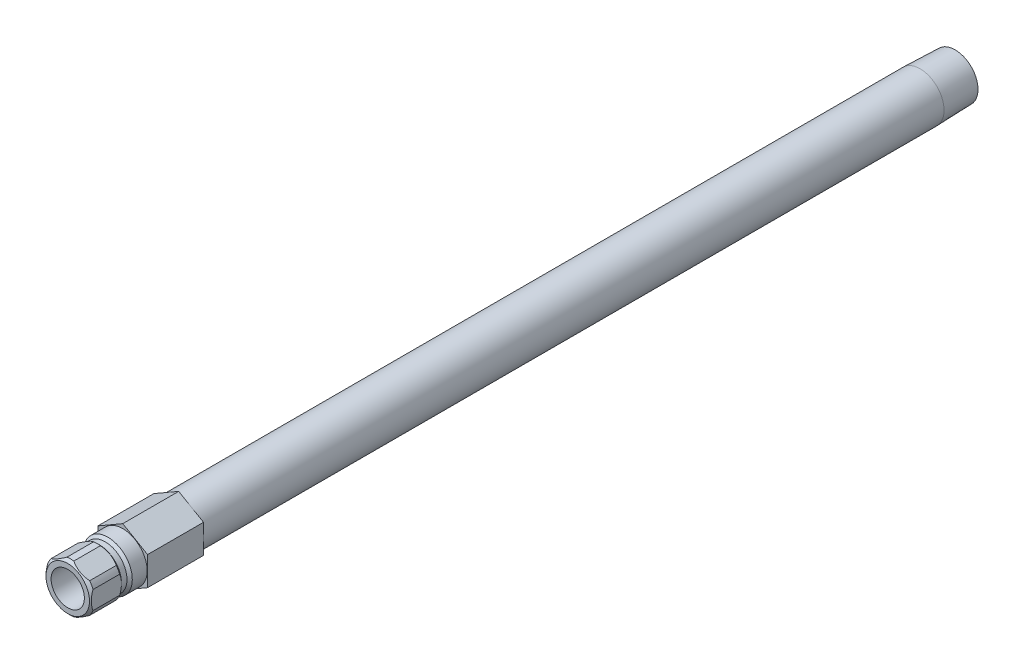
ISO-10303-21;
HEADER;
FILE_DESCRIPTION(('STEP AP214'),'2;1');
FILE_NAME('part.step','',(''),(''),'','','');
FILE_SCHEMA(('AUTOMOTIVE_DESIGN { 1 0 10303 214 1 1 1 1 }'));
ENDSEC;
DATA;
#1=APPLICATION_CONTEXT('core data for automotive mechanical design processes');
#2=APPLICATION_PROTOCOL_DEFINITION('international standard','automotive_design',2000,#1);
#3=PRODUCT_CONTEXT('',#1,'mechanical');
#4=PRODUCT('Part','Part','',(#3));
#5=PRODUCT_RELATED_PRODUCT_CATEGORY('part','',(#4));
#6=PRODUCT_DEFINITION_FORMATION('','',#4);
#7=PRODUCT_DEFINITION_CONTEXT('part definition',#1,'design');
#8=PRODUCT_DEFINITION('design','',#6,#7);
#9=PRODUCT_DEFINITION_SHAPE('','',#8);
#10=(LENGTH_UNIT() NAMED_UNIT(*) SI_UNIT(.MILLI.,.METRE.));
#11=(NAMED_UNIT(*) PLANE_ANGLE_UNIT() SI_UNIT($,.RADIAN.));
#12=(NAMED_UNIT(*) SI_UNIT($,.STERADIAN.) SOLID_ANGLE_UNIT());
#13=UNCERTAINTY_MEASURE_WITH_UNIT(LENGTH_MEASURE(1.E-05),#10,'distance_accuracy_value','');
#14=(GEOMETRIC_REPRESENTATION_CONTEXT(3) GLOBAL_UNCERTAINTY_ASSIGNED_CONTEXT((#13)) GLOBAL_UNIT_ASSIGNED_CONTEXT((#10,
#11,#12)) REPRESENTATION_CONTEXT('',''));
#15=CARTESIAN_POINT('',(0.,0.,0.));
#16=DIRECTION('',(0.,0.,1.));
#17=DIRECTION('',(1.,0.,0.));
#18=AXIS2_PLACEMENT_3D('',#15,#16,#17);
#19=CARTESIAN_POINT('',(0.,0.,12.8748331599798));
#20=DIRECTION('',(0.,0.,-1.));
#21=DIRECTION('',(0.,1.,0.));
#22=AXIS2_PLACEMENT_3D('',#19,#20,#21);
#23=CYLINDRICAL_SURFACE('',#22,6.985);
#24=DIRECTION('',(0.,0.,-1.));
#25=VECTOR('',#24,1.);
#26=CARTESIAN_POINT('',(5.50323442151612,-4.30170151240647,12.8748331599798));
#27=LINE('',#26,#25);
#28=CARTESIAN_POINT('',(5.50323442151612,-4.30170151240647,7.366));
#29=VERTEX_POINT('',#28);
#30=CARTESIAN_POINT('',(5.50323442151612,-4.30170151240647,14.986));
#31=VERTEX_POINT('',#30);
#32=EDGE_CURVE('E452',#29,#31,#27,.F.);
#33=ORIENTED_EDGE('',*,*,#32,.F.);
#34=CARTESIAN_POINT('',(0.,0.,7.366));
#35=DIRECTION('',(0.,0.,-1.));
#36=DIRECTION('',(0.,1.,0.));
#37=AXIS2_PLACEMENT_3D('',#34,#35,#36);
#38=CIRCLE('',#37,6.985);
#39=CARTESIAN_POINT('',(6.477,-2.6150900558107,7.366));
#40=VERTEX_POINT('',#39);
#41=EDGE_CURVE('E190',#40,#29,#38,.T.);
#42=ORIENTED_EDGE('',*,*,#41,.F.);
#43=DIRECTION('',(0.,0.,-1.));
#44=VECTOR('',#43,1.);
#45=CARTESIAN_POINT('',(6.477,-2.6150900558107,12.8748331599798));
#46=LINE('',#45,#44);
#47=CARTESIAN_POINT('',(6.477,-2.6150900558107,14.986));
#48=VERTEX_POINT('',#47);
#49=EDGE_CURVE('E367',#48,#40,#46,.T.);
#50=ORIENTED_EDGE('',*,*,#49,.F.);
#51=CARTESIAN_POINT('',(0.,0.,14.986));
#52=DIRECTION('',(0.,0.,-1.));
#53=DIRECTION('',(0.,1.,0.));
#54=AXIS2_PLACEMENT_3D('',#51,#52,#53);
#55=CIRCLE('',#54,6.985);
#56=EDGE_CURVE('E355',#48,#31,#55,.T.);
#57=ORIENTED_EDGE('',*,*,#56,.T.);
#58=EDGE_LOOP('',(#33,#42,#50,#57));
#59=FACE_BOUND('',#58,.T.);
#60=ADVANCED_FACE('F34',(#59),#23,.T.);
#61=DIRECTION('',(0.,0.,-1.));
#62=VECTOR('',#61,1.);
#63=CARTESIAN_POINT('',(6.477,2.6150900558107,12.8748331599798));
#64=LINE('',#63,#62);
#65=CARTESIAN_POINT('',(6.477,2.6150900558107,7.366));
#66=VERTEX_POINT('',#65);
#67=CARTESIAN_POINT('',(6.477,2.6150900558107,14.986));
#68=VERTEX_POINT('',#67);
#69=EDGE_CURVE('E279',#66,#68,#64,.F.);
#70=ORIENTED_EDGE('',*,*,#69,.F.);
#71=CARTESIAN_POINT('',(5.50323442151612,4.30170151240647,7.366));
#72=VERTEX_POINT('',#71);
#73=EDGE_CURVE('E193',#72,#66,#38,.T.);
#74=ORIENTED_EDGE('',*,*,#73,.F.);
#75=DIRECTION('',(0.,0.,-1.));
#76=VECTOR('',#75,1.);
#77=CARTESIAN_POINT('',(5.50323442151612,4.30170151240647,12.8748331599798));
#78=LINE('',#77,#76);
#79=CARTESIAN_POINT('',(5.50323442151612,4.30170151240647,14.986));
#80=VERTEX_POINT('',#79);
#81=EDGE_CURVE('E351',#80,#72,#78,.T.);
#82=ORIENTED_EDGE('',*,*,#81,.F.);
#83=EDGE_CURVE('E205',#80,#68,#55,.T.);
#84=ORIENTED_EDGE('',*,*,#83,.T.);
#85=EDGE_LOOP('',(#70,#74,#82,#84));
#86=FACE_BOUND('',#85,.T.);
#87=ADVANCED_FACE('F313',(#86),#23,.T.);
#88=DIRECTION('',(0.,0.,-1.));
#89=VECTOR('',#88,1.);
#90=CARTESIAN_POINT('',(0.973765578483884,6.91679156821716,12.8748331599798));
#91=LINE('',#90,#89);
#92=CARTESIAN_POINT('',(0.973765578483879,6.91679156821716,7.366));
#93=VERTEX_POINT('',#92);
#94=CARTESIAN_POINT('',(0.973765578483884,6.91679156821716,14.986));
#95=VERTEX_POINT('',#94);
#96=EDGE_CURVE('E370',#93,#95,#91,.F.);
#97=ORIENTED_EDGE('',*,*,#96,.F.);
#98=CARTESIAN_POINT('',(-0.97376557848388,6.91679156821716,7.366));
#99=VERTEX_POINT('',#98);
#100=EDGE_CURVE('E195',#99,#93,#38,.T.);
#101=ORIENTED_EDGE('',*,*,#100,.F.);
#102=DIRECTION('',(0.,0.,-1.));
#103=VECTOR('',#102,1.);
#104=CARTESIAN_POINT('',(-0.973765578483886,6.91679156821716,12.8748331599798));
#105=LINE('',#104,#103);
#106=CARTESIAN_POINT('',(-0.973765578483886,6.91679156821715,14.986));
#107=VERTEX_POINT('',#106);
#108=EDGE_CURVE('E54',#107,#99,#105,.T.);
#109=ORIENTED_EDGE('',*,*,#108,.F.);
#110=EDGE_CURVE('E201',#107,#95,#55,.T.);
#111=ORIENTED_EDGE('',*,*,#110,.T.);
#112=EDGE_LOOP('',(#97,#101,#109,#111));
#113=FACE_BOUND('',#112,.T.);
#114=ADVANCED_FACE('F318',(#113),#23,.T.);
#115=DIRECTION('',(0.,0.,-1.));
#116=VECTOR('',#115,1.);
#117=CARTESIAN_POINT('',(-5.50323442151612,4.30170151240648,12.8748331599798));
#118=LINE('',#117,#116);
#119=CARTESIAN_POINT('',(-5.50323442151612,4.30170151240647,7.366));
#120=VERTEX_POINT('',#119);
#121=CARTESIAN_POINT('',(-5.50323442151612,4.30170151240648,14.986));
#122=VERTEX_POINT('',#121);
#123=EDGE_CURVE('E349',#120,#122,#118,.F.);
#124=ORIENTED_EDGE('',*,*,#123,.F.);
#125=CARTESIAN_POINT('',(-6.477,2.61509005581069,7.366));
#126=VERTEX_POINT('',#125);
#127=EDGE_CURVE('E194',#126,#120,#38,.T.);
#128=ORIENTED_EDGE('',*,*,#127,.F.);
#129=DIRECTION('',(0.,0.,-1.));
#130=VECTOR('',#129,1.);
#131=CARTESIAN_POINT('',(-6.477,2.61509005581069,12.8748331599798));
#132=LINE('',#131,#130);
#133=CARTESIAN_POINT('',(-6.477,2.61509005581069,14.986));
#134=VERTEX_POINT('',#133);
#135=EDGE_CURVE('E62',#134,#126,#132,.T.);
#136=ORIENTED_EDGE('',*,*,#135,.F.);
#137=EDGE_CURVE('E204',#134,#122,#55,.T.);
#138=ORIENTED_EDGE('',*,*,#137,.T.);
#139=EDGE_LOOP('',(#124,#128,#136,#138));
#140=FACE_BOUND('',#139,.T.);
#141=ADVANCED_FACE('F329',(#140),#23,.T.);
#142=DIRECTION('',(0.,0.,-1.));
#143=VECTOR('',#142,1.);
#144=CARTESIAN_POINT('',(-6.477,-2.61509005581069,12.8748331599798));
#145=LINE('',#144,#143);
#146=CARTESIAN_POINT('',(-6.477,-2.61509005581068,7.366));
#147=VERTEX_POINT('',#146);
#148=CARTESIAN_POINT('',(-6.477,-2.61509005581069,14.986));
#149=VERTEX_POINT('',#148);
#150=EDGE_CURVE('E340',#147,#149,#145,.F.);
#151=ORIENTED_EDGE('',*,*,#150,.F.);
#152=CARTESIAN_POINT('',(-5.50323442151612,-4.30170151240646,7.366));
#153=VERTEX_POINT('',#152);
#154=EDGE_CURVE('E191',#153,#147,#38,.T.);
#155=ORIENTED_EDGE('',*,*,#154,.F.);
#156=DIRECTION('',(0.,0.,-1.));
#157=VECTOR('',#156,1.);
#158=CARTESIAN_POINT('',(-5.50323442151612,-4.30170151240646,12.8748331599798));
#159=LINE('',#158,#157);
#160=CARTESIAN_POINT('',(-5.50323442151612,-4.30170151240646,14.986));
#161=VERTEX_POINT('',#160);
#162=EDGE_CURVE('E168',#161,#153,#159,.T.);
#163=ORIENTED_EDGE('',*,*,#162,.F.);
#164=EDGE_CURVE('E342',#161,#149,#55,.T.);
#165=ORIENTED_EDGE('',*,*,#164,.T.);
#166=EDGE_LOOP('',(#151,#155,#163,#165));
#167=FACE_BOUND('',#166,.T.);
#168=ADVANCED_FACE('F322',(#167),#23,.T.);
#169=CARTESIAN_POINT('',(0.,0.,12.8748331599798));
#170=DIRECTION('',(0.,0.,-1.));
#171=DIRECTION('',(0.,1.,0.));
#172=AXIS2_PLACEMENT_3D('',#169,#170,#171);
#173=CYLINDRICAL_SURFACE('',#172,6.85799999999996);
#174=CARTESIAN_POINT('',(0.,0.,-228.219));
#175=DIRECTION('',(0.,0.,-1.));
#176=DIRECTION('',(0.,1.,0.));
#177=AXIS2_PLACEMENT_3D('',#174,#175,#176);
#178=CIRCLE('',#177,6.85799999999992);
#179=CARTESIAN_POINT('',(0.,6.858,-228.219));
#180=VERTEX_POINT('',#179);
#181=EDGE_CURVE('E520',#180,#180,#178,.T.);
#182=ORIENTED_EDGE('',*,*,#181,.F.);
#183=EDGE_LOOP('',(#182));
#184=FACE_BOUND('',#183,.T.);
#185=CARTESIAN_POINT('',(0.,0.,-16.002));
#186=DIRECTION('',(0.,0.,1.));
#187=DIRECTION('',(1.,0.,0.));
#188=AXIS2_PLACEMENT_3D('',#185,#186,#187);
#189=CIRCLE('',#188,6.85799999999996);
#190=CARTESIAN_POINT('',(6.85799999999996,0.,-16.002));
#191=VERTEX_POINT('',#190);
#192=EDGE_CURVE('E496',#191,#191,#189,.F.);
#193=ORIENTED_EDGE('',*,*,#192,.T.);
#194=EDGE_LOOP('',(#193));
#195=FACE_BOUND('',#194,.T.);
#196=ADVANCED_FACE('F328',(#184,#195),#173,.T.);
#197=CARTESIAN_POINT('',(0.,0.,12.8748331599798));
#198=DIRECTION('',(0.,0.,-1.));
#199=DIRECTION('',(0.,1.,0.));
#200=AXIS2_PLACEMENT_3D('',#197,#198,#199);
#201=CYLINDRICAL_SURFACE('',#200,4.7625);
#202=CARTESIAN_POINT('',(0.,0.,3.556));
#203=DIRECTION('',(0.,0.,-1.));
#204=DIRECTION('',(0.,1.,0.));
#205=AXIS2_PLACEMENT_3D('',#202,#203,#204);
#206=CIRCLE('',#205,4.76249999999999);
#207=CARTESIAN_POINT('',(0.,4.7625,3.556));
#208=VERTEX_POINT('',#207);
#209=EDGE_CURVE('E508',#208,#208,#206,.T.);
#210=ORIENTED_EDGE('',*,*,#209,.T.);
#211=EDGE_LOOP('',(#210));
#212=FACE_BOUND('',#211,.T.);
#213=CARTESIAN_POINT('',(0.,0.,15.748));
#214=DIRECTION('',(0.,0.,-1.));
#215=DIRECTION('',(0.,1.,0.));
#216=AXIS2_PLACEMENT_3D('',#213,#214,#215);
#217=CIRCLE('',#216,4.7625);
#218=CARTESIAN_POINT('',(0.,4.7625,15.748));
#219=VERTEX_POINT('',#218);
#220=EDGE_CURVE('E174',#219,#219,#217,.T.);
#221=ORIENTED_EDGE('',*,*,#220,.F.);
#222=EDGE_LOOP('',(#221));
#223=FACE_BOUND('',#222,.T.);
#224=ADVANCED_FACE('F36',(#212,#223),#201,.F.);
#225=CARTESIAN_POINT('',(0.,4.7625,15.748));
#226=DIRECTION('',(0.,0.,1.));
#227=DIRECTION('',(0.,-1.,0.));
#228=AXIS2_PLACEMENT_3D('',#225,#226,#227);
#229=PLANE('',#228);
#230=ORIENTED_EDGE('',*,*,#220,.T.);
#231=EDGE_LOOP('',(#230));
#232=FACE_BOUND('',#231,.T.);
#233=CARTESIAN_POINT('',(0.,0.,15.748));
#234=DIRECTION('',(0.,0.,-1.));
#235=DIRECTION('',(0.,1.,0.));
#236=AXIS2_PLACEMENT_3D('',#233,#234,#235);
#237=CIRCLE('',#236,6.223);
#238=CARTESIAN_POINT('',(0.,6.223,15.748));
#239=VERTEX_POINT('',#238);
#240=EDGE_CURVE('E206',#239,#239,#237,.T.);
#241=ORIENTED_EDGE('',*,*,#240,.F.);
#242=EDGE_LOOP('',(#241));
#243=FACE_BOUND('',#242,.T.);
#244=ADVANCED_FACE('F241',(#232,#243),#229,.T.);
#245=CARTESIAN_POINT('',(0.,0.,14.986));
#246=DIRECTION('',(0.,0.,-1.));
#247=DIRECTION('',(0.,1.,0.));
#248=AXIS2_PLACEMENT_3D('',#245,#246,#247);
#249=CONICAL_SURFACE('',#248,6.985,0.785398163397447);
#250=CARTESIAN_POINT('',(5.50369701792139,-4.30143443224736,14.9858));
#251=CARTESIAN_POINT('',(5.32269478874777,-4.40593611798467,15.0641166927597));
#252=CARTESIAN_POINT('',(5.13917907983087,-4.51188896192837,15.1353544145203));
#253=CARTESIAN_POINT('',(4.76736839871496,-4.72655395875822,15.2608524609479));
#254=CARTESIAN_POINT('',(4.57906245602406,-4.83527244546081,15.3150691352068));
#255=CARTESIAN_POINT('',(4.20553846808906,-5.05092662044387,15.401724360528));
#256=CARTESIAN_POINT('',(4.02044501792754,-5.15779037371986,15.4348622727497));
#257=CARTESIAN_POINT('',(3.64855359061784,-5.37250198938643,15.4802195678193));
#258=CARTESIAN_POINT('',(3.46175806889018,-5.48034843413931,15.4924653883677));
#259=CARTESIAN_POINT('',(3.08219421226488,-5.69948972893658,15.4953056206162));
#260=CARTESIAN_POINT('',(2.88942157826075,-5.81078706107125,15.4852117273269));
#261=CARTESIAN_POINT('',(2.50551871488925,-6.03243348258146,15.4426708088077));
#262=CARTESIAN_POINT('',(2.31439108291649,-6.14278107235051,15.4101933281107));
#263=CARTESIAN_POINT('',(1.92845877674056,-6.36559919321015,15.3234273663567));
#264=CARTESIAN_POINT('',(1.73378601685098,-6.47799356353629,15.268364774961));
#265=CARTESIAN_POINT('',(1.44558978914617,-6.6443837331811,15.1720079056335));
#266=CARTESIAN_POINT('',(1.35026676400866,-6.69941850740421,15.1376422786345));
#267=CARTESIAN_POINT('',(1.16086120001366,-6.80877186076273,15.0647445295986));
#268=CARTESIAN_POINT('',(1.06677820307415,-6.86309070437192,15.0262139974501));
#269=CARTESIAN_POINT('',(0.973302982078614,-6.91705864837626,14.9858));
#270=B_SPLINE_CURVE_WITH_KNOTS('',3,(#250,#251,#252,#253,#254,#255,#256,#257,#258,#259,#260,
#261,#262,#263,#264,#265,#266,#267,#268,#269),.UNSPECIFIED.,.F.,.F.,(4,2,2,2,2,2,2,2,2,4),(0.,
0.669810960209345,1.34132587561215,1.9892054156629,2.63626449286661,3.30353665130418,
3.97171850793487,4.66502165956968,5.01088265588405,5.35661208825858),.UNSPECIFIED.);
#271=CARTESIAN_POINT('',(0.973765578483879,-6.91679156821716,14.986));
#272=VERTEX_POINT('',#271);
#273=EDGE_CURVE('E451',#31,#272,#270,.T.);
#274=ORIENTED_EDGE('',*,*,#273,.F.);
#275=ORIENTED_EDGE('',*,*,#56,.F.);
#276=CARTESIAN_POINT('',(6.477,-7.50531717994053,12.0573066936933));
#277=CARTESIAN_POINT('',(6.477,-7.32278230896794,12.1954662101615));
#278=CARTESIAN_POINT('',(6.477,-7.13923073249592,12.3323042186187));
#279=CARTESIAN_POINT('',(6.477,-6.76969107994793,12.6027438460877));
#280=CARTESIAN_POINT('',(6.477,-6.58370240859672,12.7363446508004));
#281=CARTESIAN_POINT('',(6.477,-6.20752484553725,13.0006667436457));
#282=CARTESIAN_POINT('',(6.477,-6.01731457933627,13.1313577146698));
#283=CARTESIAN_POINT('',(6.477,-5.63367369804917,13.3879087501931));
#284=CARTESIAN_POINT('',(6.477,-5.44024331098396,13.5137691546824));
#285=CARTESIAN_POINT('',(6.477,-5.03831720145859,13.7667102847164));
#286=CARTESIAN_POINT('',(6.477,-4.8295984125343,13.893438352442));
#287=CARTESIAN_POINT('',(6.477,-4.4072839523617,14.1386241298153));
#288=CARTESIAN_POINT('',(6.477,-4.19368750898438,14.2570805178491));
#289=CARTESIAN_POINT('',(6.477,-3.7616267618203,14.4831715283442));
#290=CARTESIAN_POINT('',(6.477,-3.54317924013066,14.5908379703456));
#291=CARTESIAN_POINT('',(6.477,-3.100295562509,14.7929384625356));
#292=CARTESIAN_POINT('',(6.477,-2.87586219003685,14.8873785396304));
#293=CARTESIAN_POINT('',(6.477,-2.43955826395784,15.0524966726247));
#294=CARTESIAN_POINT('',(6.477,-2.22819339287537,15.1244971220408));
#295=CARTESIAN_POINT('',(6.477,-1.80033354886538,15.2515475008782));
#296=CARTESIAN_POINT('',(6.477,-1.58383822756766,15.3065962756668));
#297=CARTESIAN_POINT('',(6.477,-1.15063390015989,15.3959385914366));
#298=CARTESIAN_POINT('',(6.477,-0.934000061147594,15.4305906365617));
#299=CARTESIAN_POINT('',(6.477,-0.498364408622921,15.4784594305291));
#300=CARTESIAN_POINT('',(6.477,-0.279363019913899,15.4916799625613));
#301=CARTESIAN_POINT('',(6.477,0.150697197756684,15.4956835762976));
#302=CARTESIAN_POINT('',(6.477,0.361748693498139,15.4872823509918));
#303=CARTESIAN_POINT('',(6.477,0.782066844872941,15.4503172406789));
#304=CARTESIAN_POINT('',(6.477,0.991333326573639,15.421751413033));
#305=CARTESIAN_POINT('',(6.477,1.41010575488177,15.3455375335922));
#306=CARTESIAN_POINT('',(6.477,1.6195513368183,15.2975631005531));
#307=CARTESIAN_POINT('',(6.477,2.03387291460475,15.1851046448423));
#308=CARTESIAN_POINT('',(6.477,2.2387492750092,15.1206219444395));
#309=CARTESIAN_POINT('',(6.477,2.66141718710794,14.9715598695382));
#310=CARTESIAN_POINT('',(6.477,2.87875617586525,14.8857103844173));
#311=CARTESIAN_POINT('',(6.477,3.30779766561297,14.7008180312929));
#312=CARTESIAN_POINT('',(6.477,3.51949749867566,14.6017690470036));
#313=CARTESIAN_POINT('',(6.477,3.9382898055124,14.3928329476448));
#314=CARTESIAN_POINT('',(6.477,4.14536521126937,14.282911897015));
#315=CARTESIAN_POINT('',(6.477,4.55475391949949,14.0546596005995));
#316=CARTESIAN_POINT('',(6.477,4.75706796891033,13.93632968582));
#317=CARTESIAN_POINT('',(6.477,5.14761370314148,13.6989609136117));
#318=CARTESIAN_POINT('',(6.477,5.33604552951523,13.580249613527));
#319=CARTESIAN_POINT('',(6.477,5.70967381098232,13.3378251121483));
#320=CARTESIAN_POINT('',(6.477,5.89487001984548,13.2141115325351));
#321=CARTESIAN_POINT('',(6.477,6.26095063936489,12.9635958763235));
#322=CARTESIAN_POINT('',(6.477,6.44185783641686,12.8368269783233));
#323=CARTESIAN_POINT('',(6.477,6.80119835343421,12.5799293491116));
#324=CARTESIAN_POINT('',(6.477,6.97963234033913,12.4498015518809));
#325=CARTESIAN_POINT('',(6.477,7.15703038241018,12.3183002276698));
#326=B_SPLINE_CURVE_WITH_KNOTS('',3,(#276,#277,#278,#279,#280,#281,#282,#283,#284,#285,#286,
#287,#288,#289,#290,#291,#292,#293,#294,#295,#296,#297,#298,#299,#300,#301,#302,#303,#304,#305,
#306,#307,#308,#309,#310,#311,#312,#313,#314,#315,#316,#317,#318,#319,#320,#321,#322,#323,#324,
#325),.UNSPECIFIED.,.F.,.F.,(4,2,2,2,2,2,2,2,2,2,2,2,2,2,2,2,2,2,2,2,2,2,2,2,4),(0.,
0.686790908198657,1.37375281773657,2.06603541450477,2.75826919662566,3.49065471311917,
4.22315698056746,4.95343127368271,5.68337170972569,6.35265989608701,7.02199365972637,
7.67918147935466,8.33625327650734,8.96890298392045,9.6016136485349,10.2454384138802,
10.8892116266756,11.5897073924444,12.2905288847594,12.9936114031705,13.6965828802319,
14.3646145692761,15.0326968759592,15.6953618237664,16.3578444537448),.UNSPECIFIED.);
#327=EDGE_CURVE('E271',#68,#48,#326,.F.);
#328=ORIENTED_EDGE('',*,*,#327,.F.);
#329=ORIENTED_EDGE('',*,*,#83,.F.);
#330=CARTESIAN_POINT('',(0.973302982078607,6.91705864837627,14.9858));
#331=CARTESIAN_POINT('',(1.15430521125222,6.81255696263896,15.0641166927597));
#332=CARTESIAN_POINT('',(1.33782092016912,6.70660411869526,15.1353544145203));
#333=CARTESIAN_POINT('',(1.70963160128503,6.49193912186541,15.2608524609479));
#334=CARTESIAN_POINT('',(1.89793754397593,6.38322063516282,15.3150691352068));
#335=CARTESIAN_POINT('',(2.27146153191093,6.16756646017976,15.401724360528));
#336=CARTESIAN_POINT('',(2.45655498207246,6.06070270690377,15.4348622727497));
#337=CARTESIAN_POINT('',(2.82844640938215,5.8459910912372,15.4802195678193));
#338=CARTESIAN_POINT('',(3.01524193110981,5.73814464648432,15.4924653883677));
#339=CARTESIAN_POINT('',(3.39480578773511,5.51900335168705,15.4953056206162));
#340=CARTESIAN_POINT('',(3.58757842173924,5.40770601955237,15.4852117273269));
#341=CARTESIAN_POINT('',(3.97148128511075,5.18605959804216,15.4426708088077));
#342=CARTESIAN_POINT('',(4.16260891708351,5.07571200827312,15.4101933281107));
#343=CARTESIAN_POINT('',(4.54854122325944,4.85289388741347,15.3234273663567));
#344=CARTESIAN_POINT('',(4.74321398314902,4.74049951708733,15.268364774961));
#345=CARTESIAN_POINT('',(5.03141021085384,4.57410934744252,15.1720079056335));
#346=CARTESIAN_POINT('',(5.12673323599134,4.51907457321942,15.1376422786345));
#347=CARTESIAN_POINT('',(5.31613879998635,4.40972121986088,15.0647445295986));
#348=CARTESIAN_POINT('',(5.41022179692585,4.3554023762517,15.0262139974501));
#349=CARTESIAN_POINT('',(5.50369701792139,4.30143443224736,14.9858));
#350=B_SPLINE_CURVE_WITH_KNOTS('',3,(#330,#331,#332,#333,#334,#335,#336,#337,#338,#339,#340,
#341,#342,#343,#344,#345,#346,#347,#348,#349),.UNSPECIFIED.,.F.,.F.,(4,2,2,2,2,2,2,2,2,4),(0.,
0.669810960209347,1.34132587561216,1.9892054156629,2.63626449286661,3.30353665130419,
3.97171850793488,4.66502165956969,5.01088265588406,5.35661208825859),.UNSPECIFIED.);
#351=EDGE_CURVE('E263',#95,#80,#350,.T.);
#352=ORIENTED_EDGE('',*,*,#351,.F.);
#353=ORIENTED_EDGE('',*,*,#110,.F.);
#354=CARTESIAN_POINT('',(-5.50369701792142,4.30143443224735,14.9858));
#355=CARTESIAN_POINT('',(-5.3226947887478,4.40593611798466,15.0641166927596));
#356=CARTESIAN_POINT('',(-5.1391790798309,4.51188896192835,15.1353544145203));
#357=CARTESIAN_POINT('',(-4.76736839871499,4.72655395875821,15.2608524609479));
#358=CARTESIAN_POINT('',(-4.57906245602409,4.8352724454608,15.3150691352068));
#359=CARTESIAN_POINT('',(-4.20553846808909,5.05092662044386,15.401724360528));
#360=CARTESIAN_POINT('',(-4.02044501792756,5.15779037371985,15.4348622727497));
#361=CARTESIAN_POINT('',(-3.64855359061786,5.37250198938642,15.4802195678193));
#362=CARTESIAN_POINT('',(-3.4617580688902,5.4803484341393,15.4924653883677));
#363=CARTESIAN_POINT('',(-3.0821942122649,5.69948972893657,15.4953056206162));
#364=CARTESIAN_POINT('',(-2.88942157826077,5.81078706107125,15.4852117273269));
#365=CARTESIAN_POINT('',(-2.50551871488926,6.03243348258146,15.4426708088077));
#366=CARTESIAN_POINT('',(-2.3143910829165,6.14278107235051,15.4101933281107));
#367=CARTESIAN_POINT('',(-1.92845877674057,6.36559919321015,15.3234273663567));
#368=CARTESIAN_POINT('',(-1.73378601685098,6.47799356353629,15.268364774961));
#369=CARTESIAN_POINT('',(-1.44558978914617,6.6443837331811,15.1720079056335));
#370=CARTESIAN_POINT('',(-1.35026676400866,6.69941850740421,15.1376422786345));
#371=CARTESIAN_POINT('',(-1.16086120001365,6.80877186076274,15.0647445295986));
#372=CARTESIAN_POINT('',(-1.06677820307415,6.86309070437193,15.0262139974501));
#373=CARTESIAN_POINT('',(-0.97330298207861,6.91705864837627,14.9858));
#374=B_SPLINE_CURVE_WITH_KNOTS('',3,(#354,#355,#356,#357,#358,#359,#360,#361,#362,#363,#364,
#365,#366,#367,#368,#369,#370,#371,#372,#373),.UNSPECIFIED.,.F.,.F.,(4,2,2,2,2,2,2,2,2,4),(0.,
0.66981096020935,1.34132587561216,1.98920541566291,2.63626449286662,3.3035366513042,
3.9717185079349,4.66502165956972,5.01088265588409,5.35661208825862),.UNSPECIFIED.);
#375=EDGE_CURVE('E256',#122,#107,#374,.T.);
#376=ORIENTED_EDGE('',*,*,#375,.F.);
#377=ORIENTED_EDGE('',*,*,#137,.F.);
#378=CARTESIAN_POINT('',(-6.477,-7.50531717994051,12.0573066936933));
#379=CARTESIAN_POINT('',(-6.477,-7.32278230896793,12.1954662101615));
#380=CARTESIAN_POINT('',(-6.477,-7.13923073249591,12.3323042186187));
#381=CARTESIAN_POINT('',(-6.477,-6.76969107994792,12.6027438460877));
#382=CARTESIAN_POINT('',(-6.477,-6.58370240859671,12.7363446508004));
#383=CARTESIAN_POINT('',(-6.477,-6.20752484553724,13.0006667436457));
#384=CARTESIAN_POINT('',(-6.477,-6.01731457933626,13.1313577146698));
#385=CARTESIAN_POINT('',(-6.477,-5.63367369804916,13.3879087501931));
#386=CARTESIAN_POINT('',(-6.477,-5.44024331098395,13.5137691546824));
#387=CARTESIAN_POINT('',(-6.477,-5.03831720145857,13.7667102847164));
#388=CARTESIAN_POINT('',(-6.477,-4.82959841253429,13.8934383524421));
#389=CARTESIAN_POINT('',(-6.477,-4.40728395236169,14.1386241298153));
#390=CARTESIAN_POINT('',(-6.477,-4.19368750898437,14.2570805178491));
#391=CARTESIAN_POINT('',(-6.477,-3.76162676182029,14.4831715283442));
#392=CARTESIAN_POINT('',(-6.477,-3.54317924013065,14.5908379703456));
#393=CARTESIAN_POINT('',(-6.477,-3.10029556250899,14.7929384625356));
#394=CARTESIAN_POINT('',(-6.477,-2.87586219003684,14.8873785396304));
#395=CARTESIAN_POINT('',(-6.477,-2.43955826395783,15.0524966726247));
#396=CARTESIAN_POINT('',(-6.477,-2.22819339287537,15.1244971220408));
#397=CARTESIAN_POINT('',(-6.477,-1.80033354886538,15.2515475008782));
#398=CARTESIAN_POINT('',(-6.477,-1.58383822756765,15.3065962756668));
#399=CARTESIAN_POINT('',(-6.477,-1.15063390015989,15.3959385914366));
#400=CARTESIAN_POINT('',(-6.477,-0.934000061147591,15.4305906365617));
#401=CARTESIAN_POINT('',(-6.477,-0.49836440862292,15.4784594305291));
#402=CARTESIAN_POINT('',(-6.477,-0.279363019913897,15.4916799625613));
#403=CARTESIAN_POINT('',(-6.477,0.150697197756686,15.4956835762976));
#404=CARTESIAN_POINT('',(-6.477,0.361748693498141,15.4872823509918));
#405=CARTESIAN_POINT('',(-6.477,0.782066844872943,15.4503172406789));
#406=CARTESIAN_POINT('',(-6.477,0.991333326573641,15.421751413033));
#407=CARTESIAN_POINT('',(-6.477,1.41010575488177,15.3455375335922));
#408=CARTESIAN_POINT('',(-6.477,1.6195513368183,15.2975631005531));
#409=CARTESIAN_POINT('',(-6.477,2.03387291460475,15.1851046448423));
#410=CARTESIAN_POINT('',(-6.477,2.2387492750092,15.1206219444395));
#411=CARTESIAN_POINT('',(-6.477,2.66141718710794,14.9715598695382));
#412=CARTESIAN_POINT('',(-6.477,2.87875617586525,14.8857103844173));
#413=CARTESIAN_POINT('',(-6.477,3.30779766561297,14.7008180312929));
#414=CARTESIAN_POINT('',(-6.477,3.51949749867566,14.6017690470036));
#415=CARTESIAN_POINT('',(-6.477,3.93828980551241,14.3928329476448));
#416=CARTESIAN_POINT('',(-6.477,4.14536521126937,14.282911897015));
#417=CARTESIAN_POINT('',(-6.477,4.55475391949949,14.0546596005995));
#418=CARTESIAN_POINT('',(-6.477,4.75706796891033,13.93632968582));
#419=CARTESIAN_POINT('',(-6.477,5.14761370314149,13.6989609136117));
#420=CARTESIAN_POINT('',(-6.477,5.33604552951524,13.580249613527));
#421=CARTESIAN_POINT('',(-6.477,5.70967381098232,13.3378251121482));
#422=CARTESIAN_POINT('',(-6.477,5.89487001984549,13.2141115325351));
#423=CARTESIAN_POINT('',(-6.477,6.2609506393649,12.9635958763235));
#424=CARTESIAN_POINT('',(-6.477,6.44185783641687,12.8368269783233));
#425=CARTESIAN_POINT('',(-6.477,6.80119835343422,12.5799293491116));
#426=CARTESIAN_POINT('',(-6.477,6.97963234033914,12.4498015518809));
#427=CARTESIAN_POINT('',(-6.477,7.15703038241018,12.3183002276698));
#428=B_SPLINE_CURVE_WITH_KNOTS('',3,(#378,#379,#380,#381,#382,#383,#384,#385,#386,#387,#388,
#389,#390,#391,#392,#393,#394,#395,#396,#397,#398,#399,#400,#401,#402,#403,#404,#405,#406,#407,
#408,#409,#410,#411,#412,#413,#414,#415,#416,#417,#418,#419,#420,#421,#422,#423,#424,#425,#426,
#427),.UNSPECIFIED.,.F.,.F.,(4,2,2,2,2,2,2,2,2,2,2,2,2,2,2,2,2,2,2,2,2,2,2,2,4),(0.,
0.686790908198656,1.37375281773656,2.06603541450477,2.75826919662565,3.49065471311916,
4.22315698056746,4.9534312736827,5.68337170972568,6.352659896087,7.02199365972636,
7.67918147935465,8.33625327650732,8.96890298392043,9.60161364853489,10.2454384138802,
10.8892116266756,11.5897073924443,12.2905288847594,12.9936114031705,13.6965828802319,
14.3646145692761,15.0326968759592,15.6953618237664,16.3578444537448),.UNSPECIFIED.);
#429=EDGE_CURVE('E249',#149,#134,#428,.T.);
#430=ORIENTED_EDGE('',*,*,#429,.F.);
#431=ORIENTED_EDGE('',*,*,#164,.F.);
#432=CARTESIAN_POINT('',(-0.973302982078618,-6.91705864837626,14.9858));
#433=CARTESIAN_POINT('',(-1.15430521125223,-6.81255696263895,15.0641166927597));
#434=CARTESIAN_POINT('',(-1.33782092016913,-6.70660411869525,15.1353544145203));
#435=CARTESIAN_POINT('',(-1.70963160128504,-6.49193912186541,15.2608524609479));
#436=CARTESIAN_POINT('',(-1.89793754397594,-6.38322063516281,15.3150691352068));
#437=CARTESIAN_POINT('',(-2.27146153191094,-6.16756646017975,15.401724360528));
#438=CARTESIAN_POINT('',(-2.45655498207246,-6.06070270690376,15.4348622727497));
#439=CARTESIAN_POINT('',(-2.82844640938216,-5.84599109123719,15.4802195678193));
#440=CARTESIAN_POINT('',(-3.01524193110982,-5.73814464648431,15.4924653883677));
#441=CARTESIAN_POINT('',(-3.39480578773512,-5.51900335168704,15.4953056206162));
#442=CARTESIAN_POINT('',(-3.58757842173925,-5.40770601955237,15.4852117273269));
#443=CARTESIAN_POINT('',(-3.97148128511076,-5.18605959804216,15.4426708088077));
#444=CARTESIAN_POINT('',(-4.16260891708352,-5.07571200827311,15.4101933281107));
#445=CARTESIAN_POINT('',(-4.54854122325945,-4.85289388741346,15.3234273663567));
#446=CARTESIAN_POINT('',(-4.74321398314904,-4.74049951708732,15.268364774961));
#447=CARTESIAN_POINT('',(-5.03141021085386,-4.57410934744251,15.1720079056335));
#448=CARTESIAN_POINT('',(-5.12673323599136,-4.5190745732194,15.1376422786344));
#449=CARTESIAN_POINT('',(-5.31613879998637,-4.40972121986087,15.0647445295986));
#450=CARTESIAN_POINT('',(-5.41022179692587,-4.35540237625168,15.0262139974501));
#451=CARTESIAN_POINT('',(-5.50369701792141,-4.30143443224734,14.9858));
#452=B_SPLINE_CURVE_WITH_KNOTS('',3,(#432,#433,#434,#435,#436,#437,#438,#439,#440,#441,#442,
#443,#444,#445,#446,#447,#448,#449,#450,#451),.UNSPECIFIED.,.F.,.F.,(4,2,2,2,2,2,2,2,2,4),(0.,
0.669810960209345,1.34132587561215,1.9892054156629,2.6362644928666,3.30353665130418,
3.97171850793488,4.6650216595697,5.01088265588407,5.35661208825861),.UNSPECIFIED.);
#453=CARTESIAN_POINT('',(-0.973765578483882,-6.91679156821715,14.986));
#454=VERTEX_POINT('',#453);
#455=EDGE_CURVE('E184',#454,#161,#452,.T.);
#456=ORIENTED_EDGE('',*,*,#455,.F.);
#457=EDGE_CURVE('E183',#272,#454,#55,.T.);
#458=ORIENTED_EDGE('',*,*,#457,.F.);
#459=EDGE_LOOP('',(#274,#275,#328,#329,#352,#353,#376,#377,#430,#431,#456,#458));
#460=FACE_BOUND('',#459,.T.);
#461=ORIENTED_EDGE('',*,*,#240,.T.);
#462=EDGE_LOOP('',(#461));
#463=FACE_BOUND('',#462,.T.);
#464=ADVANCED_FACE('F238',(#460,#463),#249,.T.);
#465=DIRECTION('',(0.,0.,-1.));
#466=VECTOR('',#465,1.);
#467=CARTESIAN_POINT('',(0.973765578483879,-6.91679156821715,12.8748331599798));
#468=LINE('',#467,#466);
#469=CARTESIAN_POINT('',(0.973765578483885,-6.91679156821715,7.366));
#470=VERTEX_POINT('',#469);
#471=EDGE_CURVE('E278',#272,#470,#468,.T.);
#472=ORIENTED_EDGE('',*,*,#471,.F.);
#473=ORIENTED_EDGE('',*,*,#457,.T.);
#474=DIRECTION('',(0.,0.,-1.));
#475=VECTOR('',#474,1.);
#476=CARTESIAN_POINT('',(-0.973765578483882,-6.91679156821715,12.8748331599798));
#477=LINE('',#476,#475);
#478=CARTESIAN_POINT('',(-0.973765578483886,-6.91679156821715,7.366));
#479=VERTEX_POINT('',#478);
#480=EDGE_CURVE('E165',#479,#454,#477,.F.);
#481=ORIENTED_EDGE('',*,*,#480,.F.);
#482=EDGE_CURVE('E181',#470,#479,#38,.T.);
#483=ORIENTED_EDGE('',*,*,#482,.F.);
#484=EDGE_LOOP('',(#472,#473,#481,#483));
#485=FACE_BOUND('',#484,.T.);
#486=ADVANCED_FACE('F180',(#485),#23,.T.);
#487=CARTESIAN_POINT('',(0.,0.,6.604));
#488=DIRECTION('',(0.,0.,1.));
#489=DIRECTION('',(0.,-1.,0.));
#490=AXIS2_PLACEMENT_3D('',#487,#488,#489);
#491=CONICAL_SURFACE('',#490,6.223,0.785398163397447);
#492=CARTESIAN_POINT('',(0.973302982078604,-6.91705864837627,7.3662));
#493=CARTESIAN_POINT('',(1.15430521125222,-6.81255696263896,7.28788330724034));
#494=CARTESIAN_POINT('',(1.33782092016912,-6.70660411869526,7.21664558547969));
#495=CARTESIAN_POINT('',(1.70963160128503,-6.49193912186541,7.09114753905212));
#496=CARTESIAN_POINT('',(1.89793754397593,-6.38322063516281,7.03693086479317));
#497=CARTESIAN_POINT('',(2.27146153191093,-6.16756646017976,6.95027563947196));
#498=CARTESIAN_POINT('',(2.45655498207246,-6.06070270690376,6.91713772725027));
#499=CARTESIAN_POINT('',(2.82844640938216,-5.8459910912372,6.87178043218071));
#500=CARTESIAN_POINT('',(3.01524193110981,-5.73814464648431,6.85953461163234));
#501=CARTESIAN_POINT('',(3.39480578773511,-5.51900335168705,6.85669437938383));
#502=CARTESIAN_POINT('',(3.58757842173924,-5.40770601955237,6.86678827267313));
#503=CARTESIAN_POINT('',(3.97148128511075,-5.18605959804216,6.9093291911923));
#504=CARTESIAN_POINT('',(4.16260891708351,-5.07571200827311,6.9418066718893));
#505=CARTESIAN_POINT('',(4.54854122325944,-4.85289388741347,7.02857263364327));
#506=CARTESIAN_POINT('',(4.74321398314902,-4.74049951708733,7.08363522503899));
#507=CARTESIAN_POINT('',(5.03141021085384,-4.57410934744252,7.17999209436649));
#508=CARTESIAN_POINT('',(5.12673323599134,-4.51907457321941,7.21435772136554));
#509=CARTESIAN_POINT('',(5.31613879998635,-4.40972121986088,7.28725547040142));
#510=CARTESIAN_POINT('',(5.41022179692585,-4.35540237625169,7.32578600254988));
#511=CARTESIAN_POINT('',(5.50369701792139,-4.30143443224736,7.3662));
#512=B_SPLINE_CURVE_WITH_KNOTS('',3,(#492,#493,#494,#495,#496,#497,#498,#499,#500,#501,#502,
#503,#504,#505,#506,#507,#508,#509,#510,#511),.UNSPECIFIED.,.F.,.F.,(4,2,2,2,2,2,2,2,2,4),(0.,
0.669810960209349,1.34132587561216,1.9892054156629,2.63626449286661,3.30353665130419,
3.97171850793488,4.6650216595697,5.01088265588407,5.3566120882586),.UNSPECIFIED.);
#513=EDGE_CURVE('E12',#470,#29,#512,.T.);
#514=ORIENTED_EDGE('',*,*,#513,.F.);
#515=ORIENTED_EDGE('',*,*,#482,.T.);
#516=CARTESIAN_POINT('',(-5.50369701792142,-4.30143443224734,7.36620000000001));
#517=CARTESIAN_POINT('',(-5.32269478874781,-4.40593611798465,7.28788330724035));
#518=CARTESIAN_POINT('',(-5.13917907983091,-4.51188896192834,7.2166455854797));
#519=CARTESIAN_POINT('',(-4.767368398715,-4.7265539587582,7.09114753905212));
#520=CARTESIAN_POINT('',(-4.57906245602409,-4.83527244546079,7.03693086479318));
#521=CARTESIAN_POINT('',(-4.20553846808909,-5.05092662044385,6.95027563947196));
#522=CARTESIAN_POINT('',(-4.02044501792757,-5.15779037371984,6.91713772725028));
#523=CARTESIAN_POINT('',(-3.64855359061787,-5.37250198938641,6.87178043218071));
#524=CARTESIAN_POINT('',(-3.46175806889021,-5.48034843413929,6.85953461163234));
#525=CARTESIAN_POINT('',(-3.08219421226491,-5.69948972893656,6.85669437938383));
#526=CARTESIAN_POINT('',(-2.88942157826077,-5.81078706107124,6.86678827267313));
#527=CARTESIAN_POINT('',(-2.50551871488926,-6.03243348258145,6.9093291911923));
#528=CARTESIAN_POINT('',(-2.3143910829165,-6.1427810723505,6.9418066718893));
#529=CARTESIAN_POINT('',(-1.92845877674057,-6.36559919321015,7.02857263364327));
#530=CARTESIAN_POINT('',(-1.73378601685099,-6.47799356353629,7.08363522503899));
#531=CARTESIAN_POINT('',(-1.44558978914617,-6.6443837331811,7.17999209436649));
#532=CARTESIAN_POINT('',(-1.35026676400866,-6.69941850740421,7.21435772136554));
#533=CARTESIAN_POINT('',(-1.16086120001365,-6.80877186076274,7.28725547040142));
#534=CARTESIAN_POINT('',(-1.06677820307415,-6.86309070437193,7.32578600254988));
#535=CARTESIAN_POINT('',(-0.97330298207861,-6.91705864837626,7.3662));
#536=B_SPLINE_CURVE_WITH_KNOTS('',3,(#516,#517,#518,#519,#520,#521,#522,#523,#524,#525,#526,
#527,#528,#529,#530,#531,#532,#533,#534,#535),.UNSPECIFIED.,.F.,.F.,(4,2,2,2,2,2,2,2,2,4),(0.,
0.669810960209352,1.34132587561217,1.98920541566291,2.63626449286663,3.30353665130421,
3.9717185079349,4.66502165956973,5.0108826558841,5.35661208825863),.UNSPECIFIED.);
#537=EDGE_CURVE('E162',#153,#479,#536,.T.);
#538=ORIENTED_EDGE('',*,*,#537,.F.);
#539=ORIENTED_EDGE('',*,*,#154,.T.);
#540=CARTESIAN_POINT('',(-6.477,-7.50531717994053,10.2946933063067));
#541=CARTESIAN_POINT('',(-6.477,-7.32278230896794,10.1565337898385));
#542=CARTESIAN_POINT('',(-6.477,-7.13923073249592,10.0196957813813));
#543=CARTESIAN_POINT('',(-6.477,-6.76969107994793,9.74925615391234));
#544=CARTESIAN_POINT('',(-6.477,-6.58370240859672,9.61565534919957));
#545=CARTESIAN_POINT('',(-6.477,-6.20752484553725,9.35133325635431));
#546=CARTESIAN_POINT('',(-6.477,-6.01731457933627,9.22064228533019));
#547=CARTESIAN_POINT('',(-6.477,-5.63367369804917,8.96409124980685));
#548=CARTESIAN_POINT('',(-6.477,-5.44024331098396,8.83823084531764));
#549=CARTESIAN_POINT('',(-6.477,-5.03831720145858,8.58528971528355));
#550=CARTESIAN_POINT('',(-6.477,-4.8295984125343,8.45856164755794));
#551=CARTESIAN_POINT('',(-6.477,-4.4072839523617,8.21337587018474));
#552=CARTESIAN_POINT('',(-6.477,-4.19368750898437,8.09491948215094));
#553=CARTESIAN_POINT('',(-6.477,-3.7616267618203,7.8688284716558));
#554=CARTESIAN_POINT('',(-6.477,-3.54317924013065,7.76116202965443));
#555=CARTESIAN_POINT('',(-6.477,-3.100295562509,7.55906153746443));
#556=CARTESIAN_POINT('',(-6.477,-2.87586219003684,7.46462146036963));
#557=CARTESIAN_POINT('',(-6.477,-2.43955826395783,7.2995033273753));
#558=CARTESIAN_POINT('',(-6.477,-2.22819339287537,7.2275028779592));
#559=CARTESIAN_POINT('',(-6.477,-1.80033354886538,7.1004524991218));
#560=CARTESIAN_POINT('',(-6.477,-1.58383822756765,7.0454037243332));
#561=CARTESIAN_POINT('',(-6.477,-1.15063390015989,6.95606140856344));
#562=CARTESIAN_POINT('',(-6.477,-0.934000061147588,6.9214093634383));
#563=CARTESIAN_POINT('',(-6.477,-0.498364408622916,6.87354056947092));
#564=CARTESIAN_POINT('',(-6.477,-0.279363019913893,6.86032003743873));
#565=CARTESIAN_POINT('',(-6.477,0.15069719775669,6.85631642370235));
#566=CARTESIAN_POINT('',(-6.477,0.361748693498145,6.86471764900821));
#567=CARTESIAN_POINT('',(-6.477,0.782066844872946,6.90168275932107));
#568=CARTESIAN_POINT('',(-6.477,0.991333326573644,6.93024858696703));
#569=CARTESIAN_POINT('',(-6.477,1.41010575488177,7.00646246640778));
#570=CARTESIAN_POINT('',(-6.477,1.61955133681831,7.05443689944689));
#571=CARTESIAN_POINT('',(-6.477,2.03387291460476,7.16689535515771));
#572=CARTESIAN_POINT('',(-6.477,2.23874927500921,7.2313780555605));
#573=CARTESIAN_POINT('',(-6.477,2.66141718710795,7.38044013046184));
#574=CARTESIAN_POINT('',(-6.477,2.87875617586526,7.46628961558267));
#575=CARTESIAN_POINT('',(-6.477,3.30779766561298,7.65118196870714));
#576=CARTESIAN_POINT('',(-6.477,3.51949749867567,7.75023095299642));
#577=CARTESIAN_POINT('',(-6.477,3.93828980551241,7.95916705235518));
#578=CARTESIAN_POINT('',(-6.477,4.14536521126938,8.06908810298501));
#579=CARTESIAN_POINT('',(-6.477,4.5547539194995,8.2973403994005));
#580=CARTESIAN_POINT('',(-6.477,4.75706796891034,8.41567031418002));
#581=CARTESIAN_POINT('',(-6.477,5.1476137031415,8.65303908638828));
#582=CARTESIAN_POINT('',(-6.477,5.33604552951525,8.77175038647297));
#583=CARTESIAN_POINT('',(-6.477,5.70967381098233,9.01417488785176));
#584=CARTESIAN_POINT('',(-6.477,5.8948700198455,9.13788846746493));
#585=CARTESIAN_POINT('',(-6.477,6.26095063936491,9.38840412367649));
#586=CARTESIAN_POINT('',(-6.477,6.44185783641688,9.51517302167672));
#587=CARTESIAN_POINT('',(-6.477,6.80119835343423,9.7720706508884));
#588=CARTESIAN_POINT('',(-6.477,6.97963234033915,9.90219844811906));
#589=CARTESIAN_POINT('',(-6.477,7.1570303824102,10.0336997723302));
#590=B_SPLINE_CURVE_WITH_KNOTS('',3,(#540,#541,#542,#543,#544,#545,#546,#547,#548,#549,#550,
#551,#552,#553,#554,#555,#556,#557,#558,#559,#560,#561,#562,#563,#564,#565,#566,#567,#568,#569,
#570,#571,#572,#573,#574,#575,#576,#577,#578,#579,#580,#581,#582,#583,#584,#585,#586,#587,#588,
#589),.UNSPECIFIED.,.F.,.F.,(4,2,2,2,2,2,2,2,2,2,2,2,2,2,2,2,2,2,2,2,2,2,2,2,4),(0.,
0.68679090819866,1.37375281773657,2.06603541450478,2.75826919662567,3.49065471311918,
4.22315698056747,4.95343127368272,5.68337170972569,6.35265989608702,7.02199365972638,
7.67918147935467,8.33625327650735,8.96890298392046,9.60161364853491,10.2454384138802,
10.8892116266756,11.5897073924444,12.2905288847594,12.9936114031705,13.6965828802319,
14.3646145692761,15.0326968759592,15.6953618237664,16.3578444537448),.UNSPECIFIED.);
#591=EDGE_CURVE('E173',#126,#147,#590,.F.);
#592=ORIENTED_EDGE('',*,*,#591,.F.);
#593=ORIENTED_EDGE('',*,*,#127,.T.);
#594=CARTESIAN_POINT('',(-0.97330298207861,6.91705864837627,7.3662));
#595=CARTESIAN_POINT('',(-1.15430521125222,6.81255696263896,7.28788330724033));
#596=CARTESIAN_POINT('',(-1.33782092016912,6.70660411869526,7.21664558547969));
#597=CARTESIAN_POINT('',(-1.70963160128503,6.49193912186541,7.09114753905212));
#598=CARTESIAN_POINT('',(-1.89793754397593,6.38322063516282,7.03693086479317));
#599=CARTESIAN_POINT('',(-2.27146153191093,6.16756646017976,6.95027563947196));
#600=CARTESIAN_POINT('',(-2.45655498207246,6.06070270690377,6.91713772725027));
#601=CARTESIAN_POINT('',(-2.82844640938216,5.8459910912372,6.87178043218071));
#602=CARTESIAN_POINT('',(-3.01524193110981,5.73814464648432,6.85953461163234));
#603=CARTESIAN_POINT('',(-3.39480578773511,5.51900335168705,6.85669437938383));
#604=CARTESIAN_POINT('',(-3.58757842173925,5.40770601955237,6.86678827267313));
#605=CARTESIAN_POINT('',(-3.97148128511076,5.18605959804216,6.9093291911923));
#606=CARTESIAN_POINT('',(-4.16260891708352,5.07571200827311,6.9418066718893));
#607=CARTESIAN_POINT('',(-4.54854122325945,4.85289388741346,7.02857263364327));
#608=CARTESIAN_POINT('',(-4.74321398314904,4.74049951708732,7.083635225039));
#609=CARTESIAN_POINT('',(-5.03141021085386,4.57410934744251,7.1799920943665));
#610=CARTESIAN_POINT('',(-5.12673323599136,4.51907457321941,7.21435772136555));
#611=CARTESIAN_POINT('',(-5.31613879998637,4.40972121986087,7.28725547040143));
#612=CARTESIAN_POINT('',(-5.41022179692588,4.35540237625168,7.32578600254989));
#613=CARTESIAN_POINT('',(-5.50369701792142,4.30143443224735,7.36620000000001));
#614=B_SPLINE_CURVE_WITH_KNOTS('',3,(#594,#595,#596,#597,#598,#599,#600,#601,#602,#603,#604,
#605,#606,#607,#608,#609,#610,#611,#612,#613),.UNSPECIFIED.,.F.,.F.,(4,2,2,2,2,2,2,2,2,4),(0.,
0.669810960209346,1.34132587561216,1.9892054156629,2.63626449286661,3.30353665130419,
3.97171850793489,4.66502165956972,5.01088265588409,5.35661208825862),.UNSPECIFIED.);
#615=EDGE_CURVE('E299',#99,#120,#614,.T.);
#616=ORIENTED_EDGE('',*,*,#615,.F.);
#617=ORIENTED_EDGE('',*,*,#100,.T.);
#618=CARTESIAN_POINT('',(5.50369701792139,4.30143443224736,7.3662));
#619=CARTESIAN_POINT('',(5.32269478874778,4.40593611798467,7.28788330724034));
#620=CARTESIAN_POINT('',(5.13917907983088,4.51188896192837,7.21664558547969));
#621=CARTESIAN_POINT('',(4.76736839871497,4.72655395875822,7.09114753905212));
#622=CARTESIAN_POINT('',(4.57906245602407,4.83527244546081,7.03693086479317));
#623=CARTESIAN_POINT('',(4.20553846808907,5.05092662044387,6.95027563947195));
#624=CARTESIAN_POINT('',(4.02044501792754,5.15779037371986,6.91713772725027));
#625=CARTESIAN_POINT('',(3.64855359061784,5.37250198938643,6.87178043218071));
#626=CARTESIAN_POINT('',(3.46175806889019,5.48034843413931,6.85953461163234));
#627=CARTESIAN_POINT('',(3.08219421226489,5.69948972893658,6.85669437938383));
#628=CARTESIAN_POINT('',(2.88942157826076,5.81078706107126,6.86678827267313));
#629=CARTESIAN_POINT('',(2.50551871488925,6.03243348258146,6.9093291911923));
#630=CARTESIAN_POINT('',(2.31439108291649,6.14278107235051,6.9418066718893));
#631=CARTESIAN_POINT('',(1.92845877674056,6.36559919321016,7.02857263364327));
#632=CARTESIAN_POINT('',(1.73378601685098,6.4779935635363,7.08363522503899));
#633=CARTESIAN_POINT('',(1.44558978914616,6.64438373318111,7.17999209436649));
#634=CARTESIAN_POINT('',(1.35026676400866,6.69941850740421,7.21435772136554));
#635=CARTESIAN_POINT('',(1.16086120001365,6.80877186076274,7.28725547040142));
#636=CARTESIAN_POINT('',(1.06677820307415,6.86309070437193,7.32578600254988));
#637=CARTESIAN_POINT('',(0.973302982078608,6.91705864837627,7.3662));
#638=B_SPLINE_CURVE_WITH_KNOTS('',3,(#618,#619,#620,#621,#622,#623,#624,#625,#626,#627,#628,
#629,#630,#631,#632,#633,#634,#635,#636,#637),.UNSPECIFIED.,.F.,.F.,(4,2,2,2,2,2,2,2,2,4),(0.,
0.669810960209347,1.34132587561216,1.9892054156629,2.63626449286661,3.30353665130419,
3.97171850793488,4.66502165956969,5.01088265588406,5.35661208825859),.UNSPECIFIED.);
#639=EDGE_CURVE('E295',#72,#93,#638,.T.);
#640=ORIENTED_EDGE('',*,*,#639,.F.);
#641=ORIENTED_EDGE('',*,*,#73,.T.);
#642=CARTESIAN_POINT('',(6.477,-7.50531717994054,10.2946933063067));
#643=CARTESIAN_POINT('',(6.477,-7.32278230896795,10.1565337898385));
#644=CARTESIAN_POINT('',(6.477,-7.13923073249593,10.0196957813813));
#645=CARTESIAN_POINT('',(6.477,-6.76969107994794,9.74925615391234));
#646=CARTESIAN_POINT('',(6.477,-6.58370240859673,9.61565534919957));
#647=CARTESIAN_POINT('',(6.477,-6.20752484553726,9.35133325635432));
#648=CARTESIAN_POINT('',(6.477,-6.01731457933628,9.22064228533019));
#649=CARTESIAN_POINT('',(6.477,-5.63367369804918,8.96409124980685));
#650=CARTESIAN_POINT('',(6.477,-5.44024331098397,8.83823084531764));
#651=CARTESIAN_POINT('',(6.477,-5.03831720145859,8.58528971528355));
#652=CARTESIAN_POINT('',(6.477,-4.82959841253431,8.45856164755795));
#653=CARTESIAN_POINT('',(6.477,-4.4072839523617,8.21337587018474));
#654=CARTESIAN_POINT('',(6.477,-4.19368750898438,8.09491948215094));
#655=CARTESIAN_POINT('',(6.477,-3.76162676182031,7.8688284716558));
#656=CARTESIAN_POINT('',(6.477,-3.54317924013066,7.76116202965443));
#657=CARTESIAN_POINT('',(6.477,-3.100295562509,7.55906153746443));
#658=CARTESIAN_POINT('',(6.477,-2.87586219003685,7.46462146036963));
#659=CARTESIAN_POINT('',(6.477,-2.43955826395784,7.2995033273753));
#660=CARTESIAN_POINT('',(6.477,-2.22819339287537,7.2275028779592));
#661=CARTESIAN_POINT('',(6.477,-1.80033354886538,7.10045249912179));
#662=CARTESIAN_POINT('',(6.477,-1.58383822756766,7.0454037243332));
#663=CARTESIAN_POINT('',(6.477,-1.15063390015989,6.95606140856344));
#664=CARTESIAN_POINT('',(6.477,-0.934000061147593,6.92140936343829));
#665=CARTESIAN_POINT('',(6.477,-0.498364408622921,6.87354056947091));
#666=CARTESIAN_POINT('',(6.477,-0.279363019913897,6.86032003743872));
#667=CARTESIAN_POINT('',(6.477,0.150697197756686,6.85631642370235));
#668=CARTESIAN_POINT('',(6.477,0.361748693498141,6.8647176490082));
#669=CARTESIAN_POINT('',(6.477,0.782066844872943,6.90168275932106));
#670=CARTESIAN_POINT('',(6.477,0.991333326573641,6.93024858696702));
#671=CARTESIAN_POINT('',(6.477,1.41010575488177,7.00646246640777));
#672=CARTESIAN_POINT('',(6.477,1.6195513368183,7.05443689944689));
#673=CARTESIAN_POINT('',(6.477,2.03387291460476,7.16689535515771));
#674=CARTESIAN_POINT('',(6.477,2.23874927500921,7.2313780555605));
#675=CARTESIAN_POINT('',(6.477,2.66141718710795,7.38044013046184));
#676=CARTESIAN_POINT('',(6.477,2.87875617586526,7.46628961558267));
#677=CARTESIAN_POINT('',(6.477,3.30779766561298,7.65118196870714));
#678=CARTESIAN_POINT('',(6.477,3.51949749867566,7.75023095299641));
#679=CARTESIAN_POINT('',(6.477,3.93828980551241,7.95916705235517));
#680=CARTESIAN_POINT('',(6.477,4.14536521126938,8.06908810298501));
#681=CARTESIAN_POINT('',(6.477,4.55475391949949,8.29734039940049));
#682=CARTESIAN_POINT('',(6.477,4.75706796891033,8.41567031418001));
#683=CARTESIAN_POINT('',(6.477,5.14761370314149,8.65303908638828));
#684=CARTESIAN_POINT('',(6.477,5.33604552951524,8.77175038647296));
#685=CARTESIAN_POINT('',(6.477,5.70967381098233,9.01417488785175));
#686=CARTESIAN_POINT('',(6.477,5.89487001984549,9.13788846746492));
#687=CARTESIAN_POINT('',(6.477,6.2609506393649,9.38840412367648));
#688=CARTESIAN_POINT('',(6.477,6.44185783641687,9.51517302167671));
#689=CARTESIAN_POINT('',(6.477,6.80119835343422,9.77207065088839));
#690=CARTESIAN_POINT('',(6.477,6.97963234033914,9.90219844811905));
#691=CARTESIAN_POINT('',(6.477,7.15703038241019,10.0336997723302));
#692=B_SPLINE_CURVE_WITH_KNOTS('',3,(#642,#643,#644,#645,#646,#647,#648,#649,#650,#651,#652,
#653,#654,#655,#656,#657,#658,#659,#660,#661,#662,#663,#664,#665,#666,#667,#668,#669,#670,#671,
#672,#673,#674,#675,#676,#677,#678,#679,#680,#681,#682,#683,#684,#685,#686,#687,#688,#689,#690,
#691),.UNSPECIFIED.,.F.,.F.,(4,2,2,2,2,2,2,2,2,2,2,2,2,2,2,2,2,2,2,2,2,2,2,2,4),(0.,
0.686790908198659,1.37375281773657,2.06603541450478,2.75826919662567,3.49065471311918,
4.22315698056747,4.95343127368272,5.6833717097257,6.35265989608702,7.02199365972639,
7.67918147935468,8.33625327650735,8.96890298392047,9.60161364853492,10.2454384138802,
10.8892116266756,11.5897073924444,12.2905288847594,12.9936114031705,13.6965828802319,
14.3646145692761,15.0326968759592,15.6953618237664,16.3578444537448),.UNSPECIFIED.);
#693=EDGE_CURVE('E47',#40,#66,#692,.T.);
#694=ORIENTED_EDGE('',*,*,#693,.F.);
#695=ORIENTED_EDGE('',*,*,#41,.T.);
#696=EDGE_LOOP('',(#514,#515,#538,#539,#592,#593,#616,#617,#640,#641,#694,#695));
#697=FACE_BOUND('',#696,.T.);
#698=CARTESIAN_POINT('',(0.,0.,6.604));
#699=DIRECTION('',(0.,0.,-1.));
#700=DIRECTION('',(0.,1.,0.));
#701=AXIS2_PLACEMENT_3D('',#698,#699,#700);
#702=CIRCLE('',#701,6.223);
#703=CARTESIAN_POINT('',(0.,6.223,6.604));
#704=VERTEX_POINT('',#703);
#705=EDGE_CURVE('E199',#704,#704,#702,.T.);
#706=ORIENTED_EDGE('',*,*,#705,.F.);
#707=EDGE_LOOP('',(#706));
#708=FACE_BOUND('',#707,.T.);
#709=ADVANCED_FACE('F187',(#697,#708),#491,.T.);
#710=CARTESIAN_POINT('',(0.,0.,12.8748331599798));
#711=DIRECTION('',(0.,0.,-1.));
#712=DIRECTION('',(0.,1.,0.));
#713=AXIS2_PLACEMENT_3D('',#710,#711,#712);
#714=CYLINDRICAL_SURFACE('',#713,6.223);
#715=ORIENTED_EDGE('',*,*,#705,.T.);
#716=EDGE_LOOP('',(#715));
#717=FACE_BOUND('',#716,.T.);
#718=CARTESIAN_POINT('',(0.,0.,5.0165));
#719=DIRECTION('',(0.,0.,-1.));
#720=DIRECTION('',(0.,1.,0.));
#721=AXIS2_PLACEMENT_3D('',#718,#719,#720);
#722=CIRCLE('',#721,6.223);
#723=CARTESIAN_POINT('',(0.,6.223,5.0165));
#724=VERTEX_POINT('',#723);
#725=EDGE_CURVE('E528',#724,#724,#722,.T.);
#726=ORIENTED_EDGE('',*,*,#725,.F.);
#727=EDGE_LOOP('',(#726));
#728=FACE_BOUND('',#727,.T.);
#729=ADVANCED_FACE('F326',(#717,#728),#714,.T.);
#730=CARTESIAN_POINT('',(0.,0.,4.25449999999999));
#731=DIRECTION('',(0.,0.,-1.));
#732=DIRECTION('',(0.,1.,0.));
#733=AXIS2_PLACEMENT_3D('',#730,#731,#732);
#734=CONICAL_SURFACE('',#733,6.985,0.785398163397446);
#735=ORIENTED_EDGE('',*,*,#725,.T.);
#736=EDGE_LOOP('',(#735));
#737=FACE_BOUND('',#736,.T.);
#738=CARTESIAN_POINT('',(0.,0.,4.25449999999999));
#739=DIRECTION('',(0.,0.,-1.));
#740=DIRECTION('',(0.,1.,0.));
#741=AXIS2_PLACEMENT_3D('',#738,#739,#740);
#742=CIRCLE('',#741,6.985);
#743=CARTESIAN_POINT('',(0.,6.985,4.25449999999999));
#744=VERTEX_POINT('',#743);
#745=EDGE_CURVE('E526',#744,#744,#742,.T.);
#746=ORIENTED_EDGE('',*,*,#745,.F.);
#747=EDGE_LOOP('',(#746));
#748=FACE_BOUND('',#747,.T.);
#749=ADVANCED_FACE('F536',(#737,#748),#734,.T.);
#750=CARTESIAN_POINT('',(0.,0.,12.8748331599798));
#751=DIRECTION('',(0.,0.,-1.));
#752=DIRECTION('',(0.,1.,0.));
#753=AXIS2_PLACEMENT_3D('',#750,#751,#752);
#754=CYLINDRICAL_SURFACE('',#753,6.98499999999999);
#755=ORIENTED_EDGE('',*,*,#745,.T.);
#756=EDGE_LOOP('',(#755));
#757=FACE_BOUND('',#756,.T.);
#758=CARTESIAN_POINT('',(0.,0.,0.));
#759=DIRECTION('',(0.,0.,-1.));
#760=DIRECTION('',(0.,1.,0.));
#761=AXIS2_PLACEMENT_3D('',#758,#759,#760);
#762=CIRCLE('',#761,6.98499999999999);
#763=CARTESIAN_POINT('',(0.,6.985,0.));
#764=VERTEX_POINT('',#763);
#765=EDGE_CURVE('E523',#764,#764,#762,.T.);
#766=ORIENTED_EDGE('',*,*,#765,.F.);
#767=EDGE_LOOP('',(#766));
#768=FACE_BOUND('',#767,.T.);
#769=ADVANCED_FACE('F540',(#757,#768),#754,.T.);
#770=CARTESIAN_POINT('',(0.,0.,-238.252));
#771=DIRECTION('',(0.,0.,1.));
#772=DIRECTION('',(0.,-1.,0.));
#773=AXIS2_PLACEMENT_3D('',#770,#771,#772);
#774=CONICAL_SURFACE('',#773,6.54447060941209,0.0312396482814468);
#775=ORIENTED_EDGE('',*,*,#181,.T.);
#776=EDGE_LOOP('',(#775));
#777=FACE_BOUND('',#776,.T.);
#778=CARTESIAN_POINT('',(0.,0.,-238.252));
#779=DIRECTION('',(0.,0.,-1.));
#780=DIRECTION('',(0.,1.,0.));
#781=AXIS2_PLACEMENT_3D('',#778,#779,#780);
#782=CIRCLE('',#781,6.54447060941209);
#783=CARTESIAN_POINT('',(0.,6.54447060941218,-238.252));
#784=VERTEX_POINT('',#783);
#785=EDGE_CURVE('E517',#784,#784,#782,.T.);
#786=ORIENTED_EDGE('',*,*,#785,.F.);
#787=EDGE_LOOP('',(#786));
#788=FACE_BOUND('',#787,.T.);
#789=ADVANCED_FACE('F544',(#777,#788),#774,.T.);
#790=CARTESIAN_POINT('',(0.,6.54447060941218,-238.252));
#791=DIRECTION('',(0.,0.,-1.));
#792=DIRECTION('',(0.,1.,0.));
#793=AXIS2_PLACEMENT_3D('',#790,#791,#792);
#794=PLANE('',#793);
#795=ORIENTED_EDGE('',*,*,#785,.T.);
#796=EDGE_LOOP('',(#795));
#797=FACE_BOUND('',#796,.T.);
#798=CARTESIAN_POINT('',(0.,0.,-238.252));
#799=DIRECTION('',(0.,0.,-1.));
#800=DIRECTION('',(0.,1.,0.));
#801=AXIS2_PLACEMENT_3D('',#798,#799,#800);
#802=CIRCLE('',#801,4.62279999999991);
#803=CARTESIAN_POINT('',(0.,4.6228,-238.252));
#804=VERTEX_POINT('',#803);
#805=EDGE_CURVE('E514',#804,#804,#802,.T.);
#806=ORIENTED_EDGE('',*,*,#805,.F.);
#807=EDGE_LOOP('',(#806));
#808=FACE_BOUND('',#807,.T.);
#809=ADVANCED_FACE('F549',(#797,#808),#794,.T.);
#810=CARTESIAN_POINT('',(0.,0.,12.8748331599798));
#811=DIRECTION('',(0.,0.,-1.));
#812=DIRECTION('',(0.,1.,0.));
#813=AXIS2_PLACEMENT_3D('',#810,#811,#812);
#814=CYLINDRICAL_SURFACE('',#813,4.62279999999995);
#815=CARTESIAN_POINT('',(0.,0.,3.48172019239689));
#816=DIRECTION('',(0.,0.,-1.));
#817=DIRECTION('',(0.,1.,0.));
#818=AXIS2_PLACEMENT_3D('',#815,#816,#817);
#819=CIRCLE('',#818,4.6228);
#820=CARTESIAN_POINT('',(0.,4.6228,3.48172019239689));
#821=VERTEX_POINT('',#820);
#822=EDGE_CURVE('E511',#821,#821,#819,.T.);
#823=ORIENTED_EDGE('',*,*,#822,.F.);
#824=EDGE_LOOP('',(#823));
#825=FACE_BOUND('',#824,.T.);
#826=ORIENTED_EDGE('',*,*,#805,.T.);
#827=EDGE_LOOP('',(#826));
#828=FACE_BOUND('',#827,.T.);
#829=ADVANCED_FACE('F553',(#825,#828),#814,.F.);
#830=CARTESIAN_POINT('',(0.,0.,3.556));
#831=DIRECTION('',(0.,0.,1.));
#832=DIRECTION('',(0.,-1.,0.));
#833=AXIS2_PLACEMENT_3D('',#830,#831,#832);
#834=CONICAL_SURFACE('',#833,4.76249999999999,1.08210413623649);
#835=ORIENTED_EDGE('',*,*,#822,.T.);
#836=EDGE_LOOP('',(#835));
#837=FACE_BOUND('',#836,.T.);
#838=ORIENTED_EDGE('',*,*,#209,.F.);
#839=EDGE_LOOP('',(#838));
#840=FACE_BOUND('',#839,.T.);
#841=ADVANCED_FACE('F557',(#837,#840),#834,.F.);
#842=CARTESIAN_POINT('',(0.,8.21223022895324,-16.002));
#843=DIRECTION('',(-0.5,0.866025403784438,0.));
#844=DIRECTION('',(-0.866025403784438,-0.500000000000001,0.));
#845=AXIS2_PLACEMENT_3D('',#842,#843,#844);
#846=PLANE('',#845);
#847=DIRECTION('',(-0.866025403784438,-0.5,0.));
#848=VECTOR('',#847,1.);
#849=CARTESIAN_POINT('',(0.,8.21223022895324,0.));
#850=LINE('',#849,#848);
#851=CARTESIAN_POINT('',(0.,8.21223022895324,0.));
#852=VERTEX_POINT('',#851);
#853=CARTESIAN_POINT('',(-7.112,4.10611511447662,0.));
#854=VERTEX_POINT('',#853);
#855=EDGE_CURVE('E453',#852,#854,#850,.T.);
#856=ORIENTED_EDGE('',*,*,#855,.F.);
#857=DIRECTION('',(0.,0.,1.));
#858=VECTOR('',#857,1.);
#859=CARTESIAN_POINT('',(0.,8.21223022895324,-16.002));
#860=LINE('',#859,#858);
#861=CARTESIAN_POINT('',(0.,8.21223022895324,-16.002));
#862=VERTEX_POINT('',#861);
#863=EDGE_CURVE('E494',#862,#852,#860,.T.);
#864=ORIENTED_EDGE('',*,*,#863,.F.);
#865=DIRECTION('',(-0.866025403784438,-0.5,0.));
#866=VECTOR('',#865,1.);
#867=CARTESIAN_POINT('',(0.,8.21223022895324,-16.002));
#868=LINE('',#867,#866);
#869=CARTESIAN_POINT('',(-7.112,4.10611511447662,-16.002));
#870=VERTEX_POINT('',#869);
#871=EDGE_CURVE('E458',#862,#870,#868,.T.);
#872=ORIENTED_EDGE('',*,*,#871,.T.);
#873=DIRECTION('',(0.,0.,1.));
#874=VECTOR('',#873,1.);
#875=CARTESIAN_POINT('',(-7.112,4.10611511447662,-16.002));
#876=LINE('',#875,#874);
#877=EDGE_CURVE('E477',#870,#854,#876,.T.);
#878=ORIENTED_EDGE('',*,*,#877,.T.);
#879=EDGE_LOOP('',(#856,#864,#872,#878));
#880=FACE_BOUND('',#879,.T.);
#881=ADVANCED_FACE('F561',(#880),#846,.T.);
#882=CARTESIAN_POINT('',(7.112,4.10611511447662,-16.002));
#883=DIRECTION('',(0.5,0.866025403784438,0.));
#884=DIRECTION('',(-0.866025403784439,0.5,0.));
#885=AXIS2_PLACEMENT_3D('',#882,#883,#884);
#886=PLANE('',#885);
#887=DIRECTION('',(-0.866025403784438,0.5,0.));
#888=VECTOR('',#887,1.);
#889=CARTESIAN_POINT('',(7.112,4.10611511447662,0.));
#890=LINE('',#889,#888);
#891=CARTESIAN_POINT('',(7.112,4.10611511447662,0.));
#892=VERTEX_POINT('',#891);
#893=EDGE_CURVE('E462',#892,#852,#890,.T.);
#894=ORIENTED_EDGE('',*,*,#893,.F.);
#895=DIRECTION('',(0.,0.,1.));
#896=VECTOR('',#895,1.);
#897=CARTESIAN_POINT('',(7.112,4.10611511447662,-16.002));
#898=LINE('',#897,#896);
#899=CARTESIAN_POINT('',(7.112,4.10611511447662,-16.002));
#900=VERTEX_POINT('',#899);
#901=EDGE_CURVE('E497',#900,#892,#898,.T.);
#902=ORIENTED_EDGE('',*,*,#901,.F.);
#903=DIRECTION('',(-0.866025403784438,0.5,0.));
#904=VECTOR('',#903,1.);
#905=CARTESIAN_POINT('',(7.112,4.10611511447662,-16.002));
#906=LINE('',#905,#904);
#907=EDGE_CURVE('E474',#900,#862,#906,.T.);
#908=ORIENTED_EDGE('',*,*,#907,.T.);
#909=ORIENTED_EDGE('',*,*,#863,.T.);
#910=EDGE_LOOP('',(#894,#902,#908,#909));
#911=FACE_BOUND('',#910,.T.);
#912=ADVANCED_FACE('F565',(#911),#886,.T.);
#913=CARTESIAN_POINT('',(7.112,-4.10611511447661,-16.002));
#914=DIRECTION('',(1.,0.,0.));
#915=DIRECTION('',(0.,1.,0.));
#916=AXIS2_PLACEMENT_3D('',#913,#914,#915);
#917=PLANE('',#916);
#918=DIRECTION('',(0.,1.,0.));
#919=VECTOR('',#918,1.);
#920=CARTESIAN_POINT('',(7.112,-4.10611511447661,0.));
#921=LINE('',#920,#919);
#922=CARTESIAN_POINT('',(7.112,-4.10611511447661,0.));
#923=VERTEX_POINT('',#922);
#924=EDGE_CURVE('E489',#923,#892,#921,.T.);
#925=ORIENTED_EDGE('',*,*,#924,.F.);
#926=DIRECTION('',(0.,0.,1.));
#927=VECTOR('',#926,1.);
#928=CARTESIAN_POINT('',(7.112,-4.10611511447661,-16.002));
#929=LINE('',#928,#927);
#930=CARTESIAN_POINT('',(7.112,-4.10611511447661,-16.002));
#931=VERTEX_POINT('',#930);
#932=EDGE_CURVE('E499',#931,#923,#929,.T.);
#933=ORIENTED_EDGE('',*,*,#932,.F.);
#934=DIRECTION('',(0.,1.,0.));
#935=VECTOR('',#934,1.);
#936=CARTESIAN_POINT('',(7.112,-4.10611511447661,-16.002));
#937=LINE('',#936,#935);
#938=EDGE_CURVE('E471',#931,#900,#937,.T.);
#939=ORIENTED_EDGE('',*,*,#938,.T.);
#940=ORIENTED_EDGE('',*,*,#901,.T.);
#941=EDGE_LOOP('',(#925,#933,#939,#940));
#942=FACE_BOUND('',#941,.T.);
#943=ADVANCED_FACE('F579',(#942),#917,.T.);
#944=CARTESIAN_POINT('',(0.,-8.21223022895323,-16.002));
#945=DIRECTION('',(0.5,-0.866025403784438,0.));
#946=DIRECTION('',(0.866025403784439,0.5,0.));
#947=AXIS2_PLACEMENT_3D('',#944,#945,#946);
#948=PLANE('',#947);
#949=DIRECTION('',(0.866025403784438,0.5,0.));
#950=VECTOR('',#949,1.);
#951=CARTESIAN_POINT('',(0.,-8.21223022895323,0.));
#952=LINE('',#951,#950);
#953=CARTESIAN_POINT('',(0.,-8.21223022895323,0.));
#954=VERTEX_POINT('',#953);
#955=EDGE_CURVE('E486',#954,#923,#952,.T.);
#956=ORIENTED_EDGE('',*,*,#955,.F.);
#957=DIRECTION('',(0.,0.,1.));
#958=VECTOR('',#957,1.);
#959=CARTESIAN_POINT('',(0.,-8.21223022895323,-16.002));
#960=LINE('',#959,#958);
#961=CARTESIAN_POINT('',(0.,-8.21223022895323,-16.002));
#962=VERTEX_POINT('',#961);
#963=EDGE_CURVE('E501',#962,#954,#960,.T.);
#964=ORIENTED_EDGE('',*,*,#963,.F.);
#965=DIRECTION('',(0.866025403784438,0.5,0.));
#966=VECTOR('',#965,1.);
#967=CARTESIAN_POINT('',(0.,-8.21223022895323,-16.002));
#968=LINE('',#967,#966);
#969=EDGE_CURVE('E468',#962,#931,#968,.T.);
#970=ORIENTED_EDGE('',*,*,#969,.T.);
#971=ORIENTED_EDGE('',*,*,#932,.T.);
#972=EDGE_LOOP('',(#956,#964,#970,#971));
#973=FACE_BOUND('',#972,.T.);
#974=ADVANCED_FACE('F575',(#973),#948,.T.);
#975=CARTESIAN_POINT('',(-7.112,-4.10611511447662,-16.002));
#976=DIRECTION('',(-0.5,-0.866025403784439,0.));
#977=DIRECTION('',(0.866025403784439,-0.5,0.));
#978=AXIS2_PLACEMENT_3D('',#975,#976,#977);
#979=PLANE('',#978);
#980=DIRECTION('',(0.866025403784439,-0.5,0.));
#981=VECTOR('',#980,1.);
#982=CARTESIAN_POINT('',(-7.112,-4.10611511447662,0.));
#983=LINE('',#982,#981);
#984=CARTESIAN_POINT('',(-7.112,-4.10611511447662,0.));
#985=VERTEX_POINT('',#984);
#986=EDGE_CURVE('E483',#985,#954,#983,.T.);
#987=ORIENTED_EDGE('',*,*,#986,.F.);
#988=DIRECTION('',(0.,0.,1.));
#989=VECTOR('',#988,1.);
#990=CARTESIAN_POINT('',(-7.112,-4.10611511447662,-16.002));
#991=LINE('',#990,#989);
#992=CARTESIAN_POINT('',(-7.112,-4.10611511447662,-16.002));
#993=VERTEX_POINT('',#992);
#994=EDGE_CURVE('E503',#993,#985,#991,.T.);
#995=ORIENTED_EDGE('',*,*,#994,.F.);
#996=DIRECTION('',(0.866025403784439,-0.5,0.));
#997=VECTOR('',#996,1.);
#998=CARTESIAN_POINT('',(-7.112,-4.10611511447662,-16.002));
#999=LINE('',#998,#997);
#1000=EDGE_CURVE('E465',#993,#962,#999,.T.);
#1001=ORIENTED_EDGE('',*,*,#1000,.T.);
#1002=ORIENTED_EDGE('',*,*,#963,.T.);
#1003=EDGE_LOOP('',(#987,#995,#1001,#1002));
#1004=FACE_BOUND('',#1003,.T.);
#1005=ADVANCED_FACE('F571',(#1004),#979,.T.);
#1006=CARTESIAN_POINT('',(-7.112,4.10611511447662,-16.002));
#1007=DIRECTION('',(-1.,0.,0.));
#1008=DIRECTION('',(0.,-1.,0.));
#1009=AXIS2_PLACEMENT_3D('',#1006,#1007,#1008);
#1010=PLANE('',#1009);
#1011=DIRECTION('',(0.,-1.,0.));
#1012=VECTOR('',#1011,1.);
#1013=CARTESIAN_POINT('',(-7.112,4.10611511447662,0.));
#1014=LINE('',#1013,#1012);
#1015=EDGE_CURVE('E480',#854,#985,#1014,.T.);
#1016=ORIENTED_EDGE('',*,*,#1015,.F.);
#1017=ORIENTED_EDGE('',*,*,#877,.F.);
#1018=DIRECTION('',(0.,-1.,0.));
#1019=VECTOR('',#1018,1.);
#1020=CARTESIAN_POINT('',(-7.112,4.10611511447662,-16.002));
#1021=LINE('',#1020,#1019);
#1022=EDGE_CURVE('E461',#870,#993,#1021,.T.);
#1023=ORIENTED_EDGE('',*,*,#1022,.T.);
#1024=ORIENTED_EDGE('',*,*,#994,.T.);
#1025=EDGE_LOOP('',(#1016,#1017,#1023,#1024));
#1026=FACE_BOUND('',#1025,.T.);
#1027=ADVANCED_FACE('F567',(#1026),#1010,.T.);
#1028=CARTESIAN_POINT('',(-7.112,4.10611511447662,-16.002));
#1029=DIRECTION('',(0.,0.,1.));
#1030=DIRECTION('',(1.,0.,0.));
#1031=AXIS2_PLACEMENT_3D('',#1028,#1029,#1030);
#1032=PLANE('',#1031);
#1033=ORIENTED_EDGE('',*,*,#192,.F.);
#1034=EDGE_LOOP('',(#1033));
#1035=FACE_BOUND('',#1034,.T.);
#1036=ORIENTED_EDGE('',*,*,#871,.F.);
#1037=ORIENTED_EDGE('',*,*,#907,.F.);
#1038=ORIENTED_EDGE('',*,*,#938,.F.);
#1039=ORIENTED_EDGE('',*,*,#969,.F.);
#1040=ORIENTED_EDGE('',*,*,#1000,.F.);
#1041=ORIENTED_EDGE('',*,*,#1022,.F.);
#1042=EDGE_LOOP('',(#1036,#1037,#1038,#1039,#1040,#1041));
#1043=FACE_BOUND('',#1042,.T.);
#1044=ADVANCED_FACE('F570',(#1035,#1043),#1032,.F.);
#1045=CARTESIAN_POINT('',(-7.112,4.10611511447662,0.));
#1046=DIRECTION('',(0.,0.,1.));
#1047=DIRECTION('',(1.,0.,0.));
#1048=AXIS2_PLACEMENT_3D('',#1045,#1046,#1047);
#1049=PLANE('',#1048);
#1050=ORIENTED_EDGE('',*,*,#765,.T.);
#1051=EDGE_LOOP('',(#1050));
#1052=FACE_BOUND('',#1051,.T.);
#1053=ORIENTED_EDGE('',*,*,#855,.T.);
#1054=ORIENTED_EDGE('',*,*,#1015,.T.);
#1055=ORIENTED_EDGE('',*,*,#986,.T.);
#1056=ORIENTED_EDGE('',*,*,#955,.T.);
#1057=ORIENTED_EDGE('',*,*,#924,.T.);
#1058=ORIENTED_EDGE('',*,*,#893,.T.);
#1059=EDGE_LOOP('',(#1053,#1054,#1055,#1056,#1057,#1058));
#1060=FACE_BOUND('',#1059,.T.);
#1061=ADVANCED_FACE('F226',(#1052,#1060),#1049,.T.);
#1062=CARTESIAN_POINT('',(-6.477,-3.7394976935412,15.748));
#1063=DIRECTION('',(0.5,0.866025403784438,0.));
#1064=DIRECTION('',(-0.866025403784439,0.5,0.));
#1065=AXIS2_PLACEMENT_3D('',#1062,#1063,#1064);
#1066=PLANE('',#1065);
#1067=ORIENTED_EDGE('',*,*,#455,.T.);
#1068=ORIENTED_EDGE('',*,*,#162,.T.);
#1069=ORIENTED_EDGE('',*,*,#537,.T.);
#1070=ORIENTED_EDGE('',*,*,#480,.T.);
#1071=EDGE_LOOP('',(#1067,#1068,#1069,#1070));
#1072=FACE_BOUND('',#1071,.T.);
#1073=ADVANCED_FACE('F164',(#1072),#1066,.F.);
#1074=CARTESIAN_POINT('',(-6.477,3.73949769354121,15.748));
#1075=DIRECTION('',(1.,0.,0.));
#1076=DIRECTION('',(0.,1.,0.));
#1077=AXIS2_PLACEMENT_3D('',#1074,#1075,#1076);
#1078=PLANE('',#1077);
#1079=ORIENTED_EDGE('',*,*,#429,.T.);
#1080=ORIENTED_EDGE('',*,*,#135,.T.);
#1081=ORIENTED_EDGE('',*,*,#591,.T.);
#1082=ORIENTED_EDGE('',*,*,#150,.T.);
#1083=EDGE_LOOP('',(#1079,#1080,#1081,#1082));
#1084=FACE_BOUND('',#1083,.T.);
#1085=ADVANCED_FACE('F225',(#1084),#1078,.F.);
#1086=CARTESIAN_POINT('',(0.,7.47899538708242,15.748));
#1087=DIRECTION('',(0.5,-0.866025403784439,0.));
#1088=DIRECTION('',(0.866025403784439,0.5,0.));
#1089=AXIS2_PLACEMENT_3D('',#1086,#1087,#1088);
#1090=PLANE('',#1089);
#1091=ORIENTED_EDGE('',*,*,#375,.T.);
#1092=ORIENTED_EDGE('',*,*,#108,.T.);
#1093=ORIENTED_EDGE('',*,*,#615,.T.);
#1094=ORIENTED_EDGE('',*,*,#123,.T.);
#1095=EDGE_LOOP('',(#1091,#1092,#1093,#1094));
#1096=FACE_BOUND('',#1095,.T.);
#1097=ADVANCED_FACE('F303',(#1096),#1090,.F.);
#1098=CARTESIAN_POINT('',(6.477,3.73949769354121,15.748));
#1099=DIRECTION('',(-0.5,-0.866025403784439,0.));
#1100=DIRECTION('',(0.866025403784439,-0.5,0.));
#1101=AXIS2_PLACEMENT_3D('',#1098,#1099,#1100);
#1102=PLANE('',#1101);
#1103=ORIENTED_EDGE('',*,*,#351,.T.);
#1104=ORIENTED_EDGE('',*,*,#81,.T.);
#1105=ORIENTED_EDGE('',*,*,#639,.T.);
#1106=ORIENTED_EDGE('',*,*,#96,.T.);
#1107=EDGE_LOOP('',(#1103,#1104,#1105,#1106));
#1108=FACE_BOUND('',#1107,.T.);
#1109=ADVANCED_FACE('F285',(#1108),#1102,.F.);
#1110=CARTESIAN_POINT('',(6.477,-3.73949769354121,15.748));
#1111=DIRECTION('',(-1.,0.,0.));
#1112=DIRECTION('',(0.,-1.,0.));
#1113=AXIS2_PLACEMENT_3D('',#1110,#1111,#1112);
#1114=PLANE('',#1113);
#1115=ORIENTED_EDGE('',*,*,#327,.T.);
#1116=ORIENTED_EDGE('',*,*,#49,.T.);
#1117=ORIENTED_EDGE('',*,*,#693,.T.);
#1118=ORIENTED_EDGE('',*,*,#69,.T.);
#1119=EDGE_LOOP('',(#1115,#1116,#1117,#1118));
#1120=FACE_BOUND('',#1119,.T.);
#1121=ADVANCED_FACE('F281',(#1120),#1114,.F.);
#1122=CARTESIAN_POINT('',(0.,-7.47899538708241,15.748));
#1123=DIRECTION('',(-0.5,0.866025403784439,0.));
#1124=DIRECTION('',(-0.866025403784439,-0.5,0.));
#1125=AXIS2_PLACEMENT_3D('',#1122,#1123,#1124);
#1126=PLANE('',#1125);
#1127=ORIENTED_EDGE('',*,*,#273,.T.);
#1128=ORIENTED_EDGE('',*,*,#471,.T.);
#1129=ORIENTED_EDGE('',*,*,#513,.T.);
#1130=ORIENTED_EDGE('',*,*,#32,.T.);
#1131=EDGE_LOOP('',(#1127,#1128,#1129,#1130));
#1132=FACE_BOUND('',#1131,.T.);
#1133=ADVANCED_FACE('F284',(#1132),#1126,.F.);
#1134=CLOSED_SHELL('',(#60,#87,#114,#141,#168,#196,#224,#244,#464,#486,#709,#729,#749,#769,#789,
#809,#829,#841,#881,#912,#943,#974,#1005,#1027,#1044,#1061,#1073,#1085,#1097,#1109,#1121,#1133));
#1135=MANIFOLD_SOLID_BREP('B2',#1134);
#1136=ADVANCED_BREP_SHAPE_REPRESENTATION('',(#18,#1135),#14);
#1137=SHAPE_DEFINITION_REPRESENTATION(#9,#1136);
ENDSEC;
END-ISO-10303-21;
